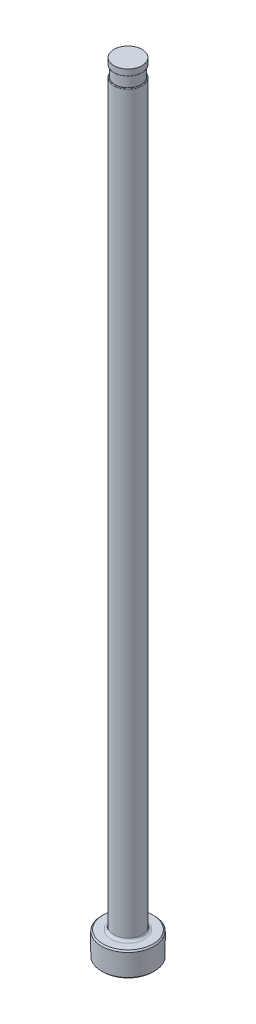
from build123d import *

# Parameters (mm, degrees)
CHAMFER1_SIZE     = 0.254
FILLET1_R         = 0.508
SKETCH2_W         = 0.2032
SKETCH2_H         = 2.032
D_SLOT_DEPTH      = 153.574351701
D_SLOT_DEPTH_BACK = 153.574351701
SKETCH5_W         = 0.01905
SKETCH5_H         = 1.27
FILLET2_R         = 0.127


with BuildPart() as part:
    # Sketch1 → Revolve1 (revolve)
    with BuildSketch(Plane.XY, mode=Mode.PRIVATE) as revolve1_sk:
        Polygon((0, 0), (-5.1562, 0), (-5.1562, 4.7498), (-2.77749, 4.7498), (-2.77749, 152.4), (0, 152.4), align=None)
    revolve(revolve1_sk.sketch.rotate(Axis((0, 259.958771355, 0), (0, -1, 0)), 270), axis=Axis((0, 259.958771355, 0), (0, -1, 0)))

    # Chamfer1
    chamfer1_edges = [part.edges().sort_by_distance(p)[0] for p in [
        (0, 4.7498, -5.1562),
        (0, 0, -5.1562),
    ]]
    chamfer(chamfer1_edges, length=CHAMFER1_SIZE)

    # Fillet1
    fillet1_edges = [part.edges().sort_by_distance(p)[0] for p in [
        (0, 4.7498, -2.77749),
    ]]
    fillet(fillet1_edges, radius=FILLET1_R)

    # Sketch2 → Vent Relief (revolve, cut)
    with BuildSketch(Plane.XY, mode=Mode.PRIVATE) as vent_relief_sk:
        with Locations((-2.67589, 150.114)):
            Rectangle(SKETCH2_W, SKETCH2_H)
    revolve(vent_relief_sk.sketch.rotate(Axis((0, 153.448281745, 0), (0, -1, 0)), 270), axis=Axis((0, 153.448281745, 0), (0, -1, 0)), mode=Mode.SUBTRACT)

    # Sketch3 → D-Slot (cut, two sides: drawn at the far end of the back side and taken through both)
    with BuildSketch(Plane.XY.offset(-D_SLOT_DEPTH_BACK)):
        with BuildLine():
            Line((-2.57429, 150.114), (-2.57429, 86.614))
            ThreePointArc((-2.57429, 86.614), (-2.625503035, 86.046038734), (-2.77749, 85.4964))
            Line((-2.77749, 85.4964), (-2.77749, 150.114))
            Line((-2.77749, 150.114), (-2.57429, 150.114))
        make_face()
    extrude(amount=D_SLOT_DEPTH + D_SLOT_DEPTH_BACK, mode=Mode.SUBTRACT)

    # Sketch5 → Vent Diameter (revolve, cut)
    with BuildSketch(Plane.XY, mode=Mode.PRIVATE) as vent_diameter_sk:
        with Locations((-2.767965, 151.765)):
            Rectangle(SKETCH5_W, SKETCH5_H)
    revolve(vent_diameter_sk.sketch.rotate(Axis((0, 152.687735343, 0), (0, -1, 0)), 90), axis=Axis((0, 152.687735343, 0), (0, -1, 0)), mode=Mode.SUBTRACT)

    # Fillet2
    fillet2_edges = [part.edges().sort_by_distance(p)[0] for p in [
        (2.303354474, 149.098, -1.552098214),
        (0, 151.13, 2.75844),
    ]]
    fillet(fillet2_edges, radius=FILLET2_R)


solid = part.part
